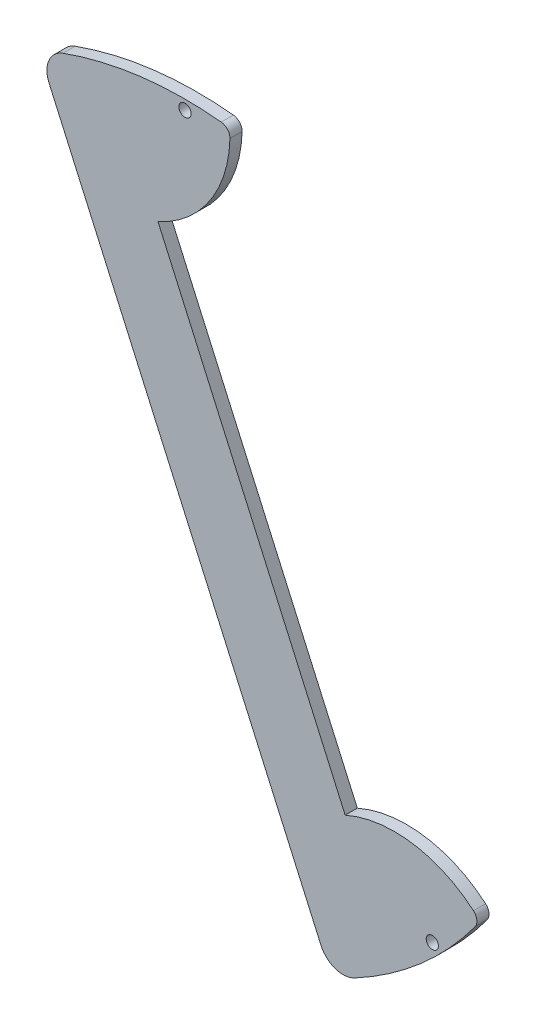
from build123d import *

# Parameters (mm, degrees)
SKETCH1_R                 = 1.59639
EXTRUDE1_DEPTH            = 3.175
F_4_40_TAPPED_HOLE2_D     = 2.2606
F_4_40_TAPPED_HOLE2_DEPTH = 8.89
F_4_40_TAPPED_HOLE2_TIP   = 0.679152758


with BuildPart() as part:
    # Sketch1 → Extrude1 (new body)
    with BuildSketch(Plane.XY):
        with BuildLine():
            Line((-35.548629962, 79.843530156), (35.548629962, -79.843530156))
            ThreePointArc((35.548629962, -79.843530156), (39.290435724, -83.267595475), (44.345994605, -82.859357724))
            ThreePointArc((44.345994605, -82.859357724), (61.618899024, -70.960211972), (75.822503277, -55.526465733))
            ThreePointArc((75.822503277, -55.526465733), (76.296274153, -53.732610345), (75.423834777, -52.095165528))
            ThreePointArc((75.423834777, -52.095165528), (59.355428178, -44.807214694), (41.877592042, -47.222408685))
            Line((41.877592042, -47.222408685), (-7.071510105, 62.719074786))
            ThreePointArc((-7.071510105, 62.719074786), (6.418283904, 74.091558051), (11.754143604, 90.90930223))
            ThreePointArc((11.754143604, 90.90930223), (11.121060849, 92.653315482), (9.470951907, 93.50155865))
            ThreePointArc((9.470951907, 93.50155865), (-11.502623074, 93.273415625), (-31.903240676, 88.399228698))
            ThreePointArc((-31.903240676, 88.399228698), (-35.589449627, 84.915380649), (-35.548629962, 79.843530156))
        make_face()
        with Locations((0, 91.44)):
            Circle(SKETCH1_R, mode=Mode.SUBTRACT)
        with Locations((64.657844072, -64.657844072)):
            Circle(SKETCH1_R, mode=Mode.SUBTRACT)
    extrude(amount=EXTRUDE1_DEPTH)

    # 4-40 Tapped Hole2
    with Locations(Plane(origin=(0, 0, 0), x_dir=(0, 0, 1), z_dir=(-0.9135454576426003, -0.4067366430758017, 0))):
        with Locations((1.5875, 76.2), (1.5875, 0), (1.5875, -76.2)):
            Hole(F_4_40_TAPPED_HOLE2_D / 2, depth=F_4_40_TAPPED_HOLE2_DEPTH)
            with Locations((0, 0, -(F_4_40_TAPPED_HOLE2_DEPTH + F_4_40_TAPPED_HOLE2_TIP / 2))):  # 118° drill point
                Cone(0, F_4_40_TAPPED_HOLE2_D / 2, F_4_40_TAPPED_HOLE2_TIP, mode=Mode.SUBTRACT)


solid = part.part
